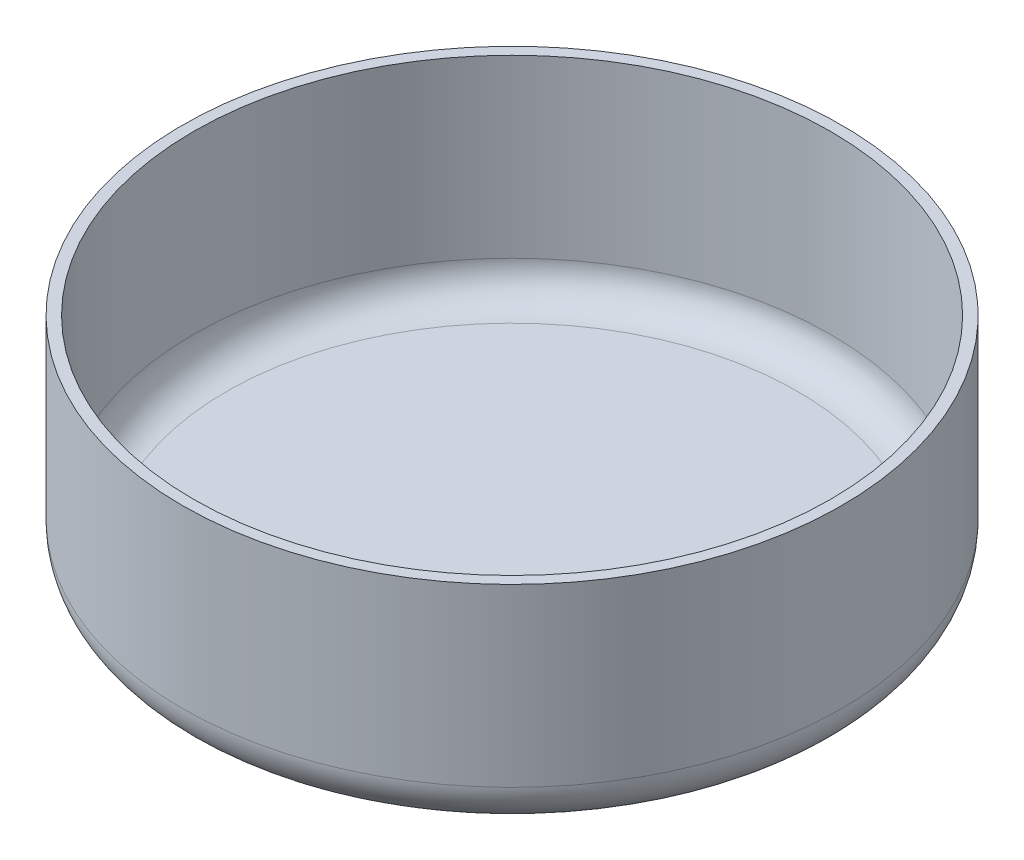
ISO-10303-21;
HEADER;
FILE_DESCRIPTION(('STEP AP214'),'2;1');
FILE_NAME('part.step','',(''),(''),'','','');
FILE_SCHEMA(('AUTOMOTIVE_DESIGN { 1 0 10303 214 1 1 1 1 }'));
ENDSEC;
DATA;
#1=APPLICATION_CONTEXT('core data for automotive mechanical design processes');
#2=APPLICATION_PROTOCOL_DEFINITION('international standard','automotive_design',2000,#1);
#3=PRODUCT_CONTEXT('',#1,'mechanical');
#4=PRODUCT('Part','Part','',(#3));
#5=PRODUCT_RELATED_PRODUCT_CATEGORY('part','',(#4));
#6=PRODUCT_DEFINITION_FORMATION('','',#4);
#7=PRODUCT_DEFINITION_CONTEXT('part definition',#1,'design');
#8=PRODUCT_DEFINITION('design','',#6,#7);
#9=PRODUCT_DEFINITION_SHAPE('','',#8);
#10=(LENGTH_UNIT() NAMED_UNIT(*) SI_UNIT(.MILLI.,.METRE.));
#11=(NAMED_UNIT(*) PLANE_ANGLE_UNIT() SI_UNIT($,.RADIAN.));
#12=(NAMED_UNIT(*) SI_UNIT($,.STERADIAN.) SOLID_ANGLE_UNIT());
#13=UNCERTAINTY_MEASURE_WITH_UNIT(LENGTH_MEASURE(1.E-05),#10,'distance_accuracy_value','');
#14=(GEOMETRIC_REPRESENTATION_CONTEXT(3) GLOBAL_UNCERTAINTY_ASSIGNED_CONTEXT((#13)) GLOBAL_UNIT_ASSIGNED_CONTEXT((#10,
#11,#12)) REPRESENTATION_CONTEXT('',''));
#15=CARTESIAN_POINT('',(0.,0.,0.));
#16=DIRECTION('',(0.,0.,1.));
#17=DIRECTION('',(1.,0.,0.));
#18=AXIS2_PLACEMENT_3D('',#15,#16,#17);
#19=CARTESIAN_POINT('',(0.,5.,0.));
#20=DIRECTION('',(0.,-1.,0.));
#21=DIRECTION('',(0.,0.,-1.));
#22=AXIS2_PLACEMENT_3D('',#19,#20,#21);
#23=PLANE('',#22);
#24=CARTESIAN_POINT('',(0.,5.,0.));
#25=DIRECTION('',(0.,1.,0.));
#26=DIRECTION('',(0.,0.,1.));
#27=AXIS2_PLACEMENT_3D('',#24,#25,#26);
#28=CIRCLE('',#27,130.);
#29=CARTESIAN_POINT('',(0.,5.,130.));
#30=VERTEX_POINT('',#29);
#31=EDGE_CURVE('E10',#30,#30,#28,.T.);
#32=ORIENTED_EDGE('',*,*,#31,.T.);
#33=EDGE_LOOP('',(#32));
#34=FACE_BOUND('',#33,.T.);
#35=ADVANCED_FACE('F30',(#34),#23,.F.);
#36=CARTESIAN_POINT('',(0.,20.,0.));
#37=DIRECTION('',(0.,1.,0.));
#38=DIRECTION('',(0.,0.,1.));
#39=AXIS2_PLACEMENT_3D('',#36,#37,#38);
#40=TOROIDAL_SURFACE('',#39,130.,15.);
#41=ORIENTED_EDGE('',*,*,#31,.F.);
#42=EDGE_LOOP('',(#41));
#43=FACE_BOUND('',#42,.T.);
#44=CARTESIAN_POINT('',(0.,20.0000000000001,0.));
#45=DIRECTION('',(0.,1.,0.));
#46=DIRECTION('',(0.,0.,1.));
#47=AXIS2_PLACEMENT_3D('',#44,#45,#46);
#48=CIRCLE('',#47,145.);
#49=CARTESIAN_POINT('',(0.,20.0000000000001,145.));
#50=VERTEX_POINT('',#49);
#51=EDGE_CURVE('E36',#50,#50,#48,.T.);
#52=ORIENTED_EDGE('',*,*,#51,.T.);
#53=EDGE_LOOP('',(#52));
#54=FACE_BOUND('',#53,.T.);
#55=ADVANCED_FACE('F68',(#43,#54),#40,.F.);
#56=CARTESIAN_POINT('',(0.,80.4367049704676,0.));
#57=DIRECTION('',(0.,1.,0.));
#58=DIRECTION('',(0.,0.,1.));
#59=AXIS2_PLACEMENT_3D('',#56,#57,#58);
#60=CYLINDRICAL_SURFACE('',#59,145.);
#61=ORIENTED_EDGE('',*,*,#51,.F.);
#62=EDGE_LOOP('',(#61));
#63=FACE_BOUND('',#62,.T.);
#64=CARTESIAN_POINT('',(0.,100.,0.));
#65=DIRECTION('',(0.,1.,0.));
#66=DIRECTION('',(0.,0.,1.));
#67=AXIS2_PLACEMENT_3D('',#64,#65,#66);
#68=CIRCLE('',#67,145.);
#69=CARTESIAN_POINT('',(0.,100.,145.));
#70=VERTEX_POINT('',#69);
#71=EDGE_CURVE('E40',#70,#70,#68,.T.);
#72=ORIENTED_EDGE('',*,*,#71,.T.);
#73=EDGE_LOOP('',(#72));
#74=FACE_BOUND('',#73,.T.);
#75=ADVANCED_FACE('F72',(#63,#74),#60,.F.);
#76=CARTESIAN_POINT('',(150.,100.,0.));
#77=DIRECTION('',(0.,-1.,0.));
#78=DIRECTION('',(0.,0.,-1.));
#79=AXIS2_PLACEMENT_3D('',#76,#77,#78);
#80=PLANE('',#79);
#81=ORIENTED_EDGE('',*,*,#71,.F.);
#82=EDGE_LOOP('',(#81));
#83=FACE_BOUND('',#82,.T.);
#84=CARTESIAN_POINT('',(0.,100.,0.));
#85=DIRECTION('',(0.,1.,0.));
#86=DIRECTION('',(0.,0.,1.));
#87=AXIS2_PLACEMENT_3D('',#84,#85,#86);
#88=CIRCLE('',#87,150.);
#89=CARTESIAN_POINT('',(0.,100.,150.));
#90=VERTEX_POINT('',#89);
#91=EDGE_CURVE('E44',#90,#90,#88,.T.);
#92=ORIENTED_EDGE('',*,*,#91,.T.);
#93=EDGE_LOOP('',(#92));
#94=FACE_BOUND('',#93,.T.);
#95=ADVANCED_FACE('F77',(#83,#94),#80,.F.);
#96=CARTESIAN_POINT('',(0.,80.4367049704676,0.));
#97=DIRECTION('',(0.,1.,0.));
#98=DIRECTION('',(0.,0.,1.));
#99=AXIS2_PLACEMENT_3D('',#96,#97,#98);
#100=CYLINDRICAL_SURFACE('',#99,150.);
#101=ORIENTED_EDGE('',*,*,#91,.F.);
#102=EDGE_LOOP('',(#101));
#103=FACE_BOUND('',#102,.T.);
#104=CARTESIAN_POINT('',(0.,20.0000000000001,0.));
#105=DIRECTION('',(0.,1.,0.));
#106=DIRECTION('',(0.,0.,1.));
#107=AXIS2_PLACEMENT_3D('',#104,#105,#106);
#108=CIRCLE('',#107,150.);
#109=CARTESIAN_POINT('',(0.,20.0000000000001,150.));
#110=VERTEX_POINT('',#109);
#111=EDGE_CURVE('E49',#110,#110,#108,.T.);
#112=ORIENTED_EDGE('',*,*,#111,.T.);
#113=EDGE_LOOP('',(#112));
#114=FACE_BOUND('',#113,.T.);
#115=ADVANCED_FACE('F64',(#103,#114),#100,.T.);
#116=CARTESIAN_POINT('',(0.,20.,0.));
#117=DIRECTION('',(0.,1.,0.));
#118=DIRECTION('',(0.,0.,1.));
#119=AXIS2_PLACEMENT_3D('',#116,#117,#118);
#120=TOROIDAL_SURFACE('',#119,130.,20.);
#121=ORIENTED_EDGE('',*,*,#111,.F.);
#122=EDGE_LOOP('',(#121));
#123=FACE_BOUND('',#122,.T.);
#124=CARTESIAN_POINT('',(0.,0.,0.));
#125=DIRECTION('',(0.,1.,0.));
#126=DIRECTION('',(0.,0.,1.));
#127=AXIS2_PLACEMENT_3D('',#124,#125,#126);
#128=CIRCLE('',#127,130.);
#129=CARTESIAN_POINT('',(0.,0.,130.));
#130=VERTEX_POINT('',#129);
#131=EDGE_CURVE('E52',#130,#130,#128,.T.);
#132=ORIENTED_EDGE('',*,*,#131,.T.);
#133=EDGE_LOOP('',(#132));
#134=FACE_BOUND('',#133,.T.);
#135=ADVANCED_FACE('F56',(#123,#134),#120,.T.);
#136=CARTESIAN_POINT('',(0.,0.,0.));
#137=DIRECTION('',(0.,1.,0.));
#138=DIRECTION('',(0.,0.,1.));
#139=AXIS2_PLACEMENT_3D('',#136,#137,#138);
#140=PLANE('',#139);
#141=ORIENTED_EDGE('',*,*,#131,.F.);
#142=EDGE_LOOP('',(#141));
#143=FACE_BOUND('',#142,.T.);
#144=ADVANCED_FACE('F58',(#143),#140,.F.);
#145=CLOSED_SHELL('',(#35,#55,#75,#95,#115,#135,#144));
#146=MANIFOLD_SOLID_BREP('B2',#145);
#147=ADVANCED_BREP_SHAPE_REPRESENTATION('',(#18,#146),#14);
#148=SHAPE_DEFINITION_REPRESENTATION(#9,#147);
ENDSEC;
END-ISO-10303-21;
